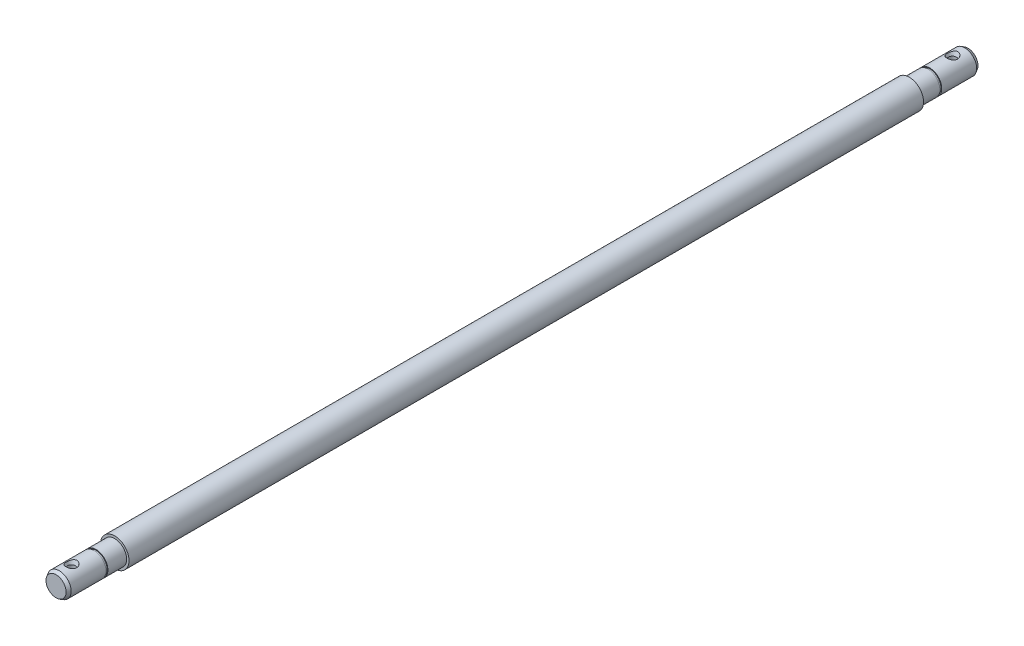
ISO-10303-21;
HEADER;
FILE_DESCRIPTION(('STEP AP214'),'2;1');
FILE_NAME('part.step','',(''),(''),'','','');
FILE_SCHEMA(('AUTOMOTIVE_DESIGN { 1 0 10303 214 1 1 1 1 }'));
ENDSEC;
DATA;
#1=APPLICATION_CONTEXT('core data for automotive mechanical design processes');
#2=APPLICATION_PROTOCOL_DEFINITION('international standard','automotive_design',2000,#1);
#3=PRODUCT_CONTEXT('',#1,'mechanical');
#4=PRODUCT('Part','Part','',(#3));
#5=PRODUCT_RELATED_PRODUCT_CATEGORY('part','',(#4));
#6=PRODUCT_DEFINITION_FORMATION('','',#4);
#7=PRODUCT_DEFINITION_CONTEXT('part definition',#1,'design');
#8=PRODUCT_DEFINITION('design','',#6,#7);
#9=PRODUCT_DEFINITION_SHAPE('','',#8);
#10=(LENGTH_UNIT() NAMED_UNIT(*) SI_UNIT(.MILLI.,.METRE.));
#11=(NAMED_UNIT(*) PLANE_ANGLE_UNIT() SI_UNIT($,.RADIAN.));
#12=(NAMED_UNIT(*) SI_UNIT($,.STERADIAN.) SOLID_ANGLE_UNIT());
#13=UNCERTAINTY_MEASURE_WITH_UNIT(LENGTH_MEASURE(1.E-05),#10,'distance_accuracy_value','');
#14=(GEOMETRIC_REPRESENTATION_CONTEXT(3) GLOBAL_UNCERTAINTY_ASSIGNED_CONTEXT((#13)) GLOBAL_UNIT_ASSIGNED_CONTEXT((#10,
#11,#12)) REPRESENTATION_CONTEXT('',''));
#15=CARTESIAN_POINT('',(0.,0.,0.));
#16=DIRECTION('',(0.,0.,1.));
#17=DIRECTION('',(1.,0.,0.));
#18=AXIS2_PLACEMENT_3D('',#15,#16,#17);
#19=CARTESIAN_POINT('',(0.,0.,287.5));
#20=DIRECTION('',(0.,0.,-1.));
#21=DIRECTION('',(-1.,0.,0.));
#22=AXIS2_PLACEMENT_3D('',#19,#20,#21);
#23=CYLINDRICAL_SURFACE('',#22,7.5);
#24=CARTESIAN_POINT('',(0.,0.,2.));
#25=DIRECTION('',(0.,0.,1.));
#26=DIRECTION('',(1.,0.,0.));
#27=AXIS2_PLACEMENT_3D('',#24,#25,#26);
#28=CIRCLE('',#27,7.5);
#29=CARTESIAN_POINT('',(7.5,0.,2.));
#30=VERTEX_POINT('',#29);
#31=EDGE_CURVE('E78',#30,#30,#28,.T.);
#32=ORIENTED_EDGE('',*,*,#31,.T.);
#33=EDGE_LOOP('',(#32));
#34=FACE_BOUND('',#33,.T.);
#35=CARTESIAN_POINT('',(-2.37306753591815,-7.11467190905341,7.39909261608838));
#36=CARTESIAN_POINT('',(-2.50121158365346,-7.07193088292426,7.55360555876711));
#37=CARTESIAN_POINT('',(-2.6158120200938,-7.02986523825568,7.71956594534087));
#38=CARTESIAN_POINT('',(-2.81591307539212,-6.95213613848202,8.06953074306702));
#39=CARTESIAN_POINT('',(-2.90141119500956,-6.91647323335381,8.25353670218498));
#40=CARTESIAN_POINT('',(-3.04098717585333,-6.85624986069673,8.63315832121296));
#41=CARTESIAN_POINT('',(-3.09530860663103,-6.83160366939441,8.8286704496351));
#42=CARTESIAN_POINT('',(-3.17208576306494,-6.79630034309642,9.2270275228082));
#43=CARTESIAN_POINT('',(-3.19455717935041,-6.78563632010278,9.42986880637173));
#44=CARTESIAN_POINT('',(-3.20679414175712,-6.77986041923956,9.83112233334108));
#45=CARTESIAN_POINT('',(-3.1974472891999,-6.78432645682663,10.0295018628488));
#46=CARTESIAN_POINT('',(-3.14829126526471,-6.80727397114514,10.421622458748));
#47=CARTESIAN_POINT('',(-3.10847828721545,-6.82575719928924,10.6153629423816));
#48=CARTESIAN_POINT('',(-2.99998724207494,-6.87412053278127,10.9911195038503));
#49=CARTESIAN_POINT('',(-2.93157227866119,-6.90389653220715,11.1732254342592));
#50=CARTESIAN_POINT('',(-2.76736656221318,-6.97133665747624,11.5231227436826));
#51=CARTESIAN_POINT('',(-2.67156566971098,-7.00900370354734,11.690908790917));
#52=CARTESIAN_POINT('',(-2.45019952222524,-7.08949046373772,12.0137537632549));
#53=CARTESIAN_POINT('',(-2.32367261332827,-7.13244837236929,12.1681214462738));
#54=CARTESIAN_POINT('',(-2.04493399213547,-7.21729993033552,12.4521343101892));
#55=CARTESIAN_POINT('',(-1.89272280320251,-7.25919360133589,12.5817799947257));
#56=CARTESIAN_POINT('',(-1.57132075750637,-7.33534097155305,12.8069693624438));
#57=CARTESIAN_POINT('',(-1.40291512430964,-7.3698115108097,12.9035518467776));
#58=CARTESIAN_POINT('',(-1.04938107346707,-7.42837229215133,13.063510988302));
#59=CARTESIAN_POINT('',(-0.864275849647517,-7.45247667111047,13.1269328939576));
#60=CARTESIAN_POINT('',(-0.508927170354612,-7.48455525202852,13.2104997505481));
#61=CARTESIAN_POINT('',(-0.339910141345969,-7.49422789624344,13.235223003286));
#62=CARTESIAN_POINT('',(8.58694290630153E-05,-7.50192226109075,13.254926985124));
#63=CARTESIAN_POINT('',(0.171063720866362,-7.49995038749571,13.2499240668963));
#64=CARTESIAN_POINT('',(0.493511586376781,-7.48532783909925,13.2123484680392));
#65=CARTESIAN_POINT('',(0.645336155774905,-7.47366979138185,13.18233774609));
#66=CARTESIAN_POINT('',(0.941719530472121,-7.44213572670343,13.09956667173));
#67=CARTESIAN_POINT('',(1.08627758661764,-7.42225886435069,13.046803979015));
#68=CARTESIAN_POINT('',(1.36989431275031,-7.37528303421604,12.918505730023));
#69=CARTESIAN_POINT('',(1.50857823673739,-7.34795371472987,12.8422314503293));
#70=CARTESIAN_POINT('',(1.77235436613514,-7.28883149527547,12.6704083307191));
#71=CARTESIAN_POINT('',(1.89744091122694,-7.25703674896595,12.5748515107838));
#72=CARTESIAN_POINT('',(2.14650497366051,-7.18757188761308,12.3546114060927));
#73=CARTESIAN_POINT('',(2.26853757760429,-7.14965517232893,12.2278068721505));
#74=CARTESIAN_POINT('',(2.49185161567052,-7.07492548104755,11.9567644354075));
#75=CARTESIAN_POINT('',(2.5931206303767,-7.03811317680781,11.8125161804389));
#76=CARTESIAN_POINT('',(2.78353264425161,-6.96516210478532,11.4930616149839));
#77=CARTESIAN_POINT('',(2.87010603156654,-6.9295455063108,11.3161955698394));
#78=CARTESIAN_POINT('',(3.01432345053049,-6.86804448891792,10.949448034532));
#79=CARTESIAN_POINT('',(3.0719680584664,-6.84215987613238,10.7595668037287));
#80=CARTESIAN_POINT('',(3.15757501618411,-6.80308819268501,10.3687775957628));
#81=CARTESIAN_POINT('',(3.18506185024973,-6.79010483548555,10.1677440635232));
#82=CARTESIAN_POINT('',(3.20786524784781,-6.77936394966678,9.76348346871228));
#83=CARTESIAN_POINT('',(3.2031889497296,-6.78160304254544,9.56025690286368));
#84=CARTESIAN_POINT('',(3.16256416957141,-6.8006350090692,9.16481296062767));
#85=CARTESIAN_POINT('',(3.12770147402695,-6.8169224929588,8.97245778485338));
#86=CARTESIAN_POINT('',(3.02912924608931,-6.86128775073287,8.59670045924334));
#87=CARTESIAN_POINT('',(2.96541290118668,-6.88936830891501,8.41330043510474));
#88=CARTESIAN_POINT('',(2.80910426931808,-6.95458173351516,8.05679167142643));
#89=CARTESIAN_POINT('',(2.71599528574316,-6.99187375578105,7.88393886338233));
#90=CARTESIAN_POINT('',(2.50294163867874,-7.07093881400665,7.5566704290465));
#91=CARTESIAN_POINT('',(2.38298609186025,-7.11271366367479,7.40226231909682));
#92=CARTESIAN_POINT('',(2.11524580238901,-7.1969305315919,7.11332898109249));
#93=CARTESIAN_POINT('',(1.96692109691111,-7.23936772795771,6.97929920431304));
#94=CARTESIAN_POINT('',(1.64702623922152,-7.31877036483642,6.74051652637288));
#95=CARTESIAN_POINT('',(1.47547249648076,-7.35573962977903,6.63574311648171));
#96=CARTESIAN_POINT('',(1.12883644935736,-7.41645875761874,6.46849516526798));
#97=CARTESIAN_POINT('',(0.955300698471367,-7.4410666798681,6.40317686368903));
#98=CARTESIAN_POINT('',(0.68754521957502,-7.46896259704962,6.330053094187));
#99=CARTESIAN_POINT('',(0.597046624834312,-7.47675874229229,6.30982038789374));
#100=CARTESIAN_POINT('',(0.414341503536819,-7.4891055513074,6.27791939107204));
#101=CARTESIAN_POINT('',(0.322135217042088,-7.49365666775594,6.26624990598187));
#102=CARTESIAN_POINT('',(0.068982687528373,-7.50139363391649,6.24641107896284));
#103=CARTESIAN_POINT('',(-0.0928611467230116,-7.50113984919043,6.24706089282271));
#104=CARTESIAN_POINT('',(-0.413779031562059,-7.49030156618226,6.27485218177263));
#105=CARTESIAN_POINT('',(-0.572853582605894,-7.4797189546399,6.30198881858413));
#106=CARTESIAN_POINT('',(-0.877468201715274,-7.45000319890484,6.3796599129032));
#107=CARTESIAN_POINT('',(-1.02329502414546,-7.43122781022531,6.42921829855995));
#108=CARTESIAN_POINT('',(-1.30495390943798,-7.38697913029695,6.54922428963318));
#109=CARTESIAN_POINT('',(-1.44078252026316,-7.361503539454,6.61967906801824));
#110=CARTESIAN_POINT('',(-1.72287734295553,-7.30109502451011,6.79304678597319));
#111=CARTESIAN_POINT('',(-1.86678945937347,-7.26528696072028,6.89948659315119));
#112=CARTESIAN_POINT('',(-2.1350563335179,-7.19103450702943,7.13396434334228));
#113=CARTESIAN_POINT('',(-2.25939098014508,-7.15258746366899,7.26202421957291));
#114=CARTESIAN_POINT('',(-2.37306753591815,-7.11467190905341,7.39909261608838));
#115=B_SPLINE_CURVE_WITH_KNOTS('',3,(#35,#36,#37,#38,#39,#40,#41,#42,#43,#44,#45,#46,#47,#48,
#49,#50,#51,#52,#53,#54,#55,#56,#57,#58,#59,#60,#61,#62,#63,#64,#65,#66,#67,#68,#69,#70,#71,#72,
#73,#74,#75,#76,#77,#78,#79,#80,#81,#82,#83,#84,#85,#86,#87,#88,#89,#90,#91,#92,#93,#94,#95,#96,
#97,#98,#99,#100,#101,#102,#103,#104,#105,#106,#107,#108,#109,#110,#111,#112,#113,#114),
.UNSPECIFIED.,.T.,.F.,(4,2,2,2,2,2,2,2,2,2,2,2,2,2,2,2,2,2,2,2,2,2,2,2,2,2,2,2,2,2,2,2,2,2,2,2,
2,2,2,4),(0.,0.615035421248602,1.23012364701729,1.84033865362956,2.45025293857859,
3.04329410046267,3.63640937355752,4.22418474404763,4.81217801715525,5.42170759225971,
6.03122474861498,6.61931015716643,7.20659099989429,7.71699522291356,8.22711869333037,
8.69061171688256,9.15415242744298,9.63407044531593,10.1141874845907,10.6520815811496,
11.190296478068,11.7878774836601,12.385446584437,12.9923082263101,13.5990351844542,
14.1848045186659,14.7707122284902,15.3675542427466,15.9646386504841,16.5744836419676,
17.1839000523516,17.7413829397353,18.0201527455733,18.2988836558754,18.7817032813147,
19.2644347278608,19.7279184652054,20.1915614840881,20.7366029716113,21.2822007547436),.UNSPECIFIED.);
#116=CARTESIAN_POINT('',(-2.37306753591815,-7.11467190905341,7.39909261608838));
#117=VERTEX_POINT('',#116);
#118=EDGE_CURVE('E42',#117,#117,#115,.T.);
#119=ORIENTED_EDGE('',*,*,#118,.T.);
#120=EDGE_LOOP('',(#119));
#121=FACE_BOUND('',#120,.T.);
#122=CARTESIAN_POINT('',(-2.37306753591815,7.11467190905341,7.39909261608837));
#123=CARTESIAN_POINT('',(-2.24488078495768,7.15742863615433,7.24454331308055));
#124=CARTESIAN_POINT('',(-2.10290799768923,7.20093586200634,7.10117163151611));
#125=CARTESIAN_POINT('',(-1.79373474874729,7.28409692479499,6.84226600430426));
#126=CARTESIAN_POINT('',(-1.62647474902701,7.32374129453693,6.72679947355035));
#127=CARTESIAN_POINT('',(-1.36703329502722,7.37483905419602,6.58301825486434));
#128=CARTESIAN_POINT('',(-1.28286151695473,7.3899858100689,6.54123326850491));
#129=CARTESIAN_POINT('',(-1.11069652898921,7.41781213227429,6.46549018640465));
#130=CARTESIAN_POINT('',(-1.02270546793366,7.43049306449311,6.43152775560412));
#131=CARTESIAN_POINT('',(-0.843705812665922,7.45293762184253,6.37199137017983));
#132=CARTESIAN_POINT('',(-0.752701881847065,7.46270554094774,6.346405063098));
#133=CARTESIAN_POINT('',(-0.568428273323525,7.4790016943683,6.30398480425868));
#134=CARTESIAN_POINT('',(-0.475158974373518,7.48553046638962,6.28714939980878));
#135=CARTESIAN_POINT('',(-0.218867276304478,7.49855715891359,6.25362861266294));
#136=CARTESIAN_POINT('',(-0.0543784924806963,7.50158944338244,6.24593105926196));
#137=CARTESIAN_POINT('',(0.273303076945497,7.49681287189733,6.25815531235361));
#138=CARTESIAN_POINT('',(0.436496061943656,7.48900571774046,6.27807278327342));
#139=CARTESIAN_POINT('',(0.747114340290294,7.46422643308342,6.3423686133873));
#140=CARTESIAN_POINT('',(0.894902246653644,7.44782106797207,6.38523749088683));
#141=CARTESIAN_POINT('',(1.18138730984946,7.40778466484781,6.49243225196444));
#142=CARTESIAN_POINT('',(1.32008292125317,7.38415240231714,6.55676177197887));
#143=CARTESIAN_POINT('',(1.59464002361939,7.3299385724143,6.70941645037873));
#144=CARTESIAN_POINT('',(1.72969749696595,7.29899899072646,6.79905443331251));
#145=CARTESIAN_POINT('',(1.98440380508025,7.23391026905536,6.9970670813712));
#146=CARTESIAN_POINT('',(2.10404487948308,7.19975952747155,7.10545111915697));
#147=CARTESIAN_POINT('',(2.34071164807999,7.12659254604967,7.35312641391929));
#148=CARTESIAN_POINT('',(2.45543881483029,7.08751346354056,7.49459836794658));
#149=CARTESIAN_POINT('',(2.66186356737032,7.01260059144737,7.79425859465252));
#150=CARTESIAN_POINT('',(2.75354914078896,6.97676850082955,7.95245552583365));
#151=CARTESIAN_POINT('',(2.91959464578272,6.90903376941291,8.29677937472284));
#152=CARTESIAN_POINT('',(2.99167563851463,6.87776795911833,8.48413889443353));
#153=CARTESIAN_POINT('',(3.10515375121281,6.82729210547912,8.86946106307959));
#154=CARTESIAN_POINT('',(3.14655764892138,6.80807939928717,9.06742135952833));
#155=CARTESIAN_POINT('',(3.19727248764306,6.78441186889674,9.46635184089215));
#156=CARTESIAN_POINT('',(3.20688978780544,6.77981618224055,9.66727443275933));
#157=CARTESIAN_POINT('',(3.19457781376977,6.78562566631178,10.0679147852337));
#158=CARTESIAN_POINT('',(3.1726508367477,6.79602974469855,10.2676326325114));
#159=CARTESIAN_POINT('',(3.09892200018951,6.82995196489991,10.6548294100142));
#160=CARTESIAN_POINT('',(3.04791361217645,6.85312127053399,10.8424916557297));
#161=CARTESIAN_POINT('',(2.91789035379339,6.90947961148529,11.2062772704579));
#162=CARTESIAN_POINT('',(2.8388668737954,6.94267172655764,11.3823970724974));
#163=CARTESIAN_POINT('',(2.65137653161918,7.01645560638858,11.724144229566));
#164=CARTESIAN_POINT('',(2.54205010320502,7.05724980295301,11.8892569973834));
#165=CARTESIAN_POINT('',(2.2969379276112,7.14078509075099,12.1981119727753));
#166=CARTESIAN_POINT('',(2.16114452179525,7.1835267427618,12.3418479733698));
#167=CARTESIAN_POINT('',(1.86560786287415,7.26587689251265,12.6028169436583));
#168=CARTESIAN_POINT('',(1.70590917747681,7.30549101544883,12.720098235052));
#169=CARTESIAN_POINT('',(1.36590222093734,7.37660607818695,12.9230116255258));
#170=CARTESIAN_POINT('',(1.18561727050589,7.40811606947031,13.0086790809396));
#171=CARTESIAN_POINT('',(0.831186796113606,7.45569738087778,13.135599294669));
#172=CARTESIAN_POINT('',(0.658624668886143,7.47310489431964,13.1807588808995));
#173=CARTESIAN_POINT('',(0.307447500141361,7.49575293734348,13.2392323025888));
#174=CARTESIAN_POINT('',(0.128838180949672,7.5010046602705,13.252575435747));
#175=CARTESIAN_POINT('',(-0.206482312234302,7.49880851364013,13.2469475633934));
#176=CARTESIAN_POINT('',(-0.363278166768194,7.49279301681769,13.2316215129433));
#177=CARTESIAN_POINT('',(-0.671812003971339,7.47145064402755,13.17645036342));
#178=CARTESIAN_POINT('',(-0.823550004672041,7.45612380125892,13.1366053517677));
#179=CARTESIAN_POINT('',(-1.11762451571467,7.41774057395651,13.0344599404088));
#180=CARTESIAN_POINT('',(-1.25998806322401,7.39470769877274,12.9722277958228));
#181=CARTESIAN_POINT('',(-1.53300828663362,7.34297093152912,12.8277546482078));
#182=CARTESIAN_POINT('',(-1.66366127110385,7.31426526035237,12.7455073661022));
#183=CARTESIAN_POINT('',(-1.92411120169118,7.25035161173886,12.5541374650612));
#184=CARTESIAN_POINT('',(-2.05241908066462,7.21477813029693,12.4431139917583));
#185=CARTESIAN_POINT('',(-2.2906187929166,7.1427293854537,12.2030534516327));
#186=CARTESIAN_POINT('',(-2.40049963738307,7.10625359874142,12.0740057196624));
#187=CARTESIAN_POINT('',(-2.61298434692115,7.03111378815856,11.7838250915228));
#188=CARTESIAN_POINT('',(-2.71297829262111,6.99274286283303,11.6206978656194));
#189=CARTESIAN_POINT('',(-2.88637925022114,6.9229746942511,11.2794734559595));
#190=CARTESIAN_POINT('',(-2.95977932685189,6.89157927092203,11.1013723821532));
#191=CARTESIAN_POINT('',(-3.08130964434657,6.83814242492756,10.7258239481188));
#192=CARTESIAN_POINT('',(-3.12808214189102,6.81661302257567,10.5278601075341));
#193=CARTESIAN_POINT('',(-3.18946153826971,6.78811563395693,10.1260430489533));
#194=CARTESIAN_POINT('',(-3.20408320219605,6.78114096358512,9.92219257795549));
#195=CARTESIAN_POINT('',(-3.20079336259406,6.78269173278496,9.52157002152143));
#196=CARTESIAN_POINT('',(-3.18393915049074,6.7907134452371,9.32478626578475));
#197=CARTESIAN_POINT('',(-3.12024216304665,6.82021223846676,8.93701961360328));
#198=CARTESIAN_POINT('',(-3.0733740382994,6.84170069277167,8.74604176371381));
#199=CARTESIAN_POINT('',(-2.9508757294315,6.89541744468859,8.37517447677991));
#200=CARTESIAN_POINT('',(-2.87523753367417,6.92764873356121,8.19528814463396));
#201=CARTESIAN_POINT('',(-2.69684981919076,6.99901069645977,7.85142151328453));
#202=CARTESIAN_POINT('',(-2.59417093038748,7.03812330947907,7.68740127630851));
#203=CARTESIAN_POINT('',(-2.4447641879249,7.09044713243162,7.48777626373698));
#204=CARTESIAN_POINT('',(-2.409471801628,7.10252925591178,7.44298368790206));
#205=CARTESIAN_POINT('',(-2.37306753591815,7.11467190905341,7.39909261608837));
#206=B_SPLINE_CURVE_WITH_KNOTS('',3,(#122,#123,#124,#125,#126,#127,#128,#129,#130,#131,#132,
#133,#134,#135,#136,#137,#138,#139,#140,#141,#142,#143,#144,#145,#146,#147,#148,#149,#150,#151,
#152,#153,#154,#155,#156,#157,#158,#159,#160,#161,#162,#163,#164,#165,#166,#167,#168,#169,#170,
#171,#172,#173,#174,#175,#176,#177,#178,#179,#180,#181,#182,#183,#184,#185,#186,#187,#188,#189,
#190,#191,#192,#193,#194,#195,#196,#197,#198,#199,#200,#201,#202,#203,#204,#205),.UNSPECIFIED.,
.T.,.F.,(4,2,2,2,2,2,2,2,2,2,2,2,2,2,2,2,2,2,2,2,2,2,2,2,2,2,2,2,2,2,2,2,2,2,2,2,2,2,2,2,2,4),
(0.,0.615711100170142,1.23289512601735,1.51809575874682,1.80313795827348,2.08775788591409,
2.37233055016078,2.8635651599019,3.35472265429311,3.81695761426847,4.27927093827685,
4.77237590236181,5.26572812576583,5.82228223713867,6.37912590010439,6.98570583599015,
7.59215171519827,8.1927353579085,8.79327526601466,9.37816431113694,9.96323326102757,
10.566983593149,11.1709088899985,11.7737219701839,12.3758588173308,12.9103892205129,
13.4444272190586,13.9151249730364,14.3858210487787,14.8550940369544,15.3245144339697,
15.8425346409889,16.3608626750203,16.9437338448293,17.5267569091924,18.1373255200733,
18.7476136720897,19.3377696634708,19.9284247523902,20.5192444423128,21.1085359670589,
21.2833942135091),.UNSPECIFIED.);
#207=CARTESIAN_POINT('',(-2.37306753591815,7.11467190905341,7.39909261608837));
#208=VERTEX_POINT('',#207);
#209=EDGE_CURVE('E10',#208,#208,#206,.T.);
#210=ORIENTED_EDGE('',*,*,#209,.T.);
#211=EDGE_LOOP('',(#210));
#212=FACE_BOUND('',#211,.T.);
#213=CARTESIAN_POINT('',(0.,0.,24.));
#214=DIRECTION('',(0.,0.,-1.));
#215=DIRECTION('',(-1.,0.,0.));
#216=AXIS2_PLACEMENT_3D('',#213,#214,#215);
#217=CIRCLE('',#216,7.5);
#218=CARTESIAN_POINT('',(-7.5,0.,24.));
#219=VERTEX_POINT('',#218);
#220=EDGE_CURVE('E97',#219,#219,#217,.T.);
#221=ORIENTED_EDGE('',*,*,#220,.T.);
#222=EDGE_LOOP('',(#221));
#223=FACE_BOUND('',#222,.T.);
#224=ADVANCED_FACE('F34',(#34,#121,#212,#223),#23,.T.);
#225=CARTESIAN_POINT('',(0.,0.,0.));
#226=DIRECTION('',(0.,0.,1.));
#227=DIRECTION('',(1.,0.,0.));
#228=AXIS2_PLACEMENT_3D('',#225,#226,#227);
#229=PLANE('',#228);
#230=CARTESIAN_POINT('',(0.,0.,0.));
#231=DIRECTION('',(0.,0.,1.));
#232=DIRECTION('',(1.,0.,0.));
#233=AXIS2_PLACEMENT_3D('',#230,#231,#232);
#234=CIRCLE('',#233,6.34529946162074);
#235=CARTESIAN_POINT('',(6.34529946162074,0.,0.));
#236=VERTEX_POINT('',#235);
#237=EDGE_CURVE('E46',#236,#236,#234,.F.);
#238=ORIENTED_EDGE('',*,*,#237,.T.);
#239=EDGE_LOOP('',(#238));
#240=FACE_BOUND('',#239,.T.);
#241=ADVANCED_FACE('F67',(#240),#229,.F.);
#242=CARTESIAN_POINT('',(0.,0.,2.));
#243=DIRECTION('',(0.,0.,1.));
#244=DIRECTION('',(1.,0.,0.));
#245=AXIS2_PLACEMENT_3D('',#242,#243,#244);
#246=CONICAL_SURFACE('',#245,7.5,0.523598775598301);
#247=ORIENTED_EDGE('',*,*,#237,.F.);
#248=EDGE_LOOP('',(#247));
#249=FACE_BOUND('',#248,.T.);
#250=ORIENTED_EDGE('',*,*,#31,.F.);
#251=EDGE_LOOP('',(#250));
#252=FACE_BOUND('',#251,.T.);
#253=ADVANCED_FACE('F36',(#249,#252),#246,.T.);
#254=CARTESIAN_POINT('',(0.,7.5,9.74999999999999));
#255=DIRECTION('',(0.,1.,0.));
#256=DIRECTION('',(0.,0.,1.));
#257=AXIS2_PLACEMENT_3D('',#254,#255,#256);
#258=CONICAL_SURFACE('',#257,3.5,0.392699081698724);
#259=CARTESIAN_POINT('',(0.,5.0857864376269,9.74999999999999));
#260=DIRECTION('',(0.,1.,0.));
#261=DIRECTION('',(0.,0.,1.));
#262=AXIS2_PLACEMENT_3D('',#259,#260,#261);
#263=CIRCLE('',#262,2.5);
#264=CARTESIAN_POINT('',(0.,5.0857864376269,12.25));
#265=VERTEX_POINT('',#264);
#266=EDGE_CURVE('E80',#265,#265,#263,.T.);
#267=ORIENTED_EDGE('',*,*,#266,.F.);
#268=EDGE_LOOP('',(#267));
#269=FACE_BOUND('',#268,.T.);
#270=ORIENTED_EDGE('',*,*,#209,.F.);
#271=EDGE_LOOP('',(#270));
#272=FACE_BOUND('',#271,.T.);
#273=ADVANCED_FACE('F60',(#269,#272),#258,.F.);
#274=CARTESIAN_POINT('',(0.,-5.08578643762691,9.74999999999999));
#275=DIRECTION('',(0.,-1.,0.));
#276=DIRECTION('',(0.,0.,-1.));
#277=AXIS2_PLACEMENT_3D('',#274,#275,#276);
#278=CONICAL_SURFACE('',#277,2.5,0.392699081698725);
#279=CARTESIAN_POINT('',(0.,-5.08578643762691,9.74999999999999));
#280=DIRECTION('',(0.,1.,0.));
#281=DIRECTION('',(0.,0.,1.));
#282=AXIS2_PLACEMENT_3D('',#279,#280,#281);
#283=CIRCLE('',#282,2.5);
#284=CARTESIAN_POINT('',(0.,-5.08578643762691,12.25));
#285=VERTEX_POINT('',#284);
#286=EDGE_CURVE('E85',#285,#285,#283,.T.);
#287=ORIENTED_EDGE('',*,*,#286,.T.);
#288=EDGE_LOOP('',(#287));
#289=FACE_BOUND('',#288,.T.);
#290=ORIENTED_EDGE('',*,*,#118,.F.);
#291=EDGE_LOOP('',(#290));
#292=FACE_BOUND('',#291,.T.);
#293=ADVANCED_FACE('F64',(#289,#292),#278,.F.);
#294=CARTESIAN_POINT('',(0.,7.5,9.74999999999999));
#295=DIRECTION('',(0.,1.,0.));
#296=DIRECTION('',(0.,0.,1.));
#297=AXIS2_PLACEMENT_3D('',#294,#295,#296);
#298=CYLINDRICAL_SURFACE('',#297,2.5);
#299=ORIENTED_EDGE('',*,*,#286,.F.);
#300=EDGE_LOOP('',(#299));
#301=FACE_BOUND('',#300,.T.);
#302=ORIENTED_EDGE('',*,*,#266,.T.);
#303=EDGE_LOOP('',(#302));
#304=FACE_BOUND('',#303,.T.);
#305=ADVANCED_FACE('F66',(#301,#304),#298,.F.);
#306=CARTESIAN_POINT('',(7.5,0.,25.2));
#307=DIRECTION('',(0.,0.,-1.));
#308=DIRECTION('',(-1.,0.,0.));
#309=AXIS2_PLACEMENT_3D('',#306,#307,#308);
#310=PLANE('',#309);
#311=CARTESIAN_POINT('',(0.,0.,25.2));
#312=DIRECTION('',(0.,0.,-1.));
#313=DIRECTION('',(-1.,0.,0.));
#314=AXIS2_PLACEMENT_3D('',#311,#312,#313);
#315=CIRCLE('',#314,7.5);
#316=CARTESIAN_POINT('',(-7.5,0.,25.2));
#317=VERTEX_POINT('',#316);
#318=EDGE_CURVE('E88',#317,#317,#315,.T.);
#319=ORIENTED_EDGE('',*,*,#318,.T.);
#320=EDGE_LOOP('',(#319));
#321=FACE_BOUND('',#320,.T.);
#322=CARTESIAN_POINT('',(0.,0.,25.2));
#323=DIRECTION('',(0.,0.,-1.));
#324=DIRECTION('',(-1.,0.,0.));
#325=AXIS2_PLACEMENT_3D('',#322,#323,#324);
#326=CIRCLE('',#325,7.);
#327=CARTESIAN_POINT('',(-7.,0.,25.2));
#328=VERTEX_POINT('',#327);
#329=EDGE_CURVE('E91',#328,#328,#326,.T.);
#330=ORIENTED_EDGE('',*,*,#329,.F.);
#331=EDGE_LOOP('',(#330));
#332=FACE_BOUND('',#331,.T.);
#333=ADVANCED_FACE('F195',(#321,#332),#310,.T.);
#334=CARTESIAN_POINT('',(0.,0.,0.));
#335=DIRECTION('',(0.,0.,-1.));
#336=DIRECTION('',(-1.,0.,0.));
#337=AXIS2_PLACEMENT_3D('',#334,#335,#336);
#338=CYLINDRICAL_SURFACE('',#337,7.);
#339=ORIENTED_EDGE('',*,*,#329,.T.);
#340=EDGE_LOOP('',(#339));
#341=FACE_BOUND('',#340,.T.);
#342=CARTESIAN_POINT('',(0.,0.,24.));
#343=DIRECTION('',(0.,0.,-1.));
#344=DIRECTION('',(-1.,0.,0.));
#345=AXIS2_PLACEMENT_3D('',#342,#343,#344);
#346=CIRCLE('',#345,7.);
#347=CARTESIAN_POINT('',(-7.,0.,24.));
#348=VERTEX_POINT('',#347);
#349=EDGE_CURVE('E94',#348,#348,#346,.T.);
#350=ORIENTED_EDGE('',*,*,#349,.F.);
#351=EDGE_LOOP('',(#350));
#352=FACE_BOUND('',#351,.T.);
#353=ADVANCED_FACE('F191',(#341,#352),#338,.T.);
#354=CARTESIAN_POINT('',(7.5,0.,24.));
#355=DIRECTION('',(0.,0.,1.));
#356=DIRECTION('',(1.,0.,0.));
#357=AXIS2_PLACEMENT_3D('',#354,#355,#356);
#358=PLANE('',#357);
#359=ORIENTED_EDGE('',*,*,#349,.T.);
#360=EDGE_LOOP('',(#359));
#361=FACE_BOUND('',#360,.T.);
#362=ORIENTED_EDGE('',*,*,#220,.F.);
#363=EDGE_LOOP('',(#362));
#364=FACE_BOUND('',#363,.T.);
#365=ADVANCED_FACE('F188',(#361,#364),#358,.T.);
#366=CARTESIAN_POINT('',(0.,0.,37.));
#367=DIRECTION('',(0.,0.,-1.));
#368=DIRECTION('',(-1.,0.,0.));
#369=AXIS2_PLACEMENT_3D('',#366,#367,#368);
#370=CIRCLE('',#369,7.5);
#371=CARTESIAN_POINT('',(-7.5,0.,37.));
#372=VERTEX_POINT('',#371);
#373=EDGE_CURVE('E38',#372,#372,#370,.T.);
#374=ORIENTED_EDGE('',*,*,#373,.T.);
#375=EDGE_LOOP('',(#374));
#376=FACE_BOUND('',#375,.T.);
#377=ORIENTED_EDGE('',*,*,#318,.F.);
#378=EDGE_LOOP('',(#377));
#379=FACE_BOUND('',#378,.T.);
#380=ADVANCED_FACE('F57',(#376,#379),#23,.T.);
#381=CARTESIAN_POINT('',(0.,0.,37.));
#382=DIRECTION('',(0.,0.,-1.));
#383=DIRECTION('',(-1.,0.,0.));
#384=AXIS2_PLACEMENT_3D('',#381,#382,#383);
#385=PLANE('',#384);
#386=CARTESIAN_POINT('',(0.,0.,37.));
#387=DIRECTION('',(0.,0.,-1.));
#388=DIRECTION('',(-1.,0.,0.));
#389=AXIS2_PLACEMENT_3D('',#386,#387,#388);
#390=CIRCLE('',#389,9.);
#391=CARTESIAN_POINT('',(-9.,0.,37.));
#392=VERTEX_POINT('',#391);
#393=EDGE_CURVE('E100',#392,#392,#390,.F.);
#394=ORIENTED_EDGE('',*,*,#393,.F.);
#395=EDGE_LOOP('',(#394));
#396=FACE_BOUND('',#395,.T.);
#397=ORIENTED_EDGE('',*,*,#373,.F.);
#398=EDGE_LOOP('',(#397));
#399=FACE_BOUND('',#398,.T.);
#400=ADVANCED_FACE('F183',(#396,#399),#385,.T.);
#401=CARTESIAN_POINT('',(0.,0.,11.5441558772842));
#402=DIRECTION('',(0.,0.,1.));
#403=DIRECTION('',(1.,0.,0.));
#404=AXIS2_PLACEMENT_3D('',#401,#402,#403);
#405=CYLINDRICAL_SURFACE('',#404,9.);
#406=ORIENTED_EDGE('',*,*,#393,.T.);
#407=EDGE_LOOP('',(#406));
#408=FACE_BOUND('',#407,.T.);
#409=CARTESIAN_POINT('',(0.,0.,538.));
#410=DIRECTION('',(0.,0.,-1.));
#411=DIRECTION('',(-1.,0.,0.));
#412=AXIS2_PLACEMENT_3D('',#409,#410,#411);
#413=CIRCLE('',#412,9.);
#414=CARTESIAN_POINT('',(-9.,0.,538.));
#415=VERTEX_POINT('',#414);
#416=EDGE_CURVE('E103',#415,#415,#413,.F.);
#417=ORIENTED_EDGE('',*,*,#416,.F.);
#418=EDGE_LOOP('',(#417));
#419=FACE_BOUND('',#418,.T.);
#420=ADVANCED_FACE('F179',(#408,#419),#405,.T.);
#421=CARTESIAN_POINT('',(0.,0.,575.));
#422=DIRECTION('',(0.,0.,-1.));
#423=DIRECTION('',(1.,0.,0.));
#424=AXIS2_PLACEMENT_3D('',#421,#422,#423);
#425=PLANE('',#424);
#426=CARTESIAN_POINT('',(0.,0.,575.));
#427=DIRECTION('',(0.,0.,1.));
#428=DIRECTION('',(1.,0.,0.));
#429=AXIS2_PLACEMENT_3D('',#426,#427,#428);
#430=CIRCLE('',#429,6.34529946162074);
#431=CARTESIAN_POINT('',(6.34529946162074,0.,575.));
#432=VERTEX_POINT('',#431);
#433=EDGE_CURVE('E124',#432,#432,#430,.F.);
#434=ORIENTED_EDGE('',*,*,#433,.F.);
#435=EDGE_LOOP('',(#434));
#436=FACE_BOUND('',#435,.T.);
#437=ADVANCED_FACE('F175',(#436),#425,.F.);
#438=CARTESIAN_POINT('',(0.,0.,538.));
#439=DIRECTION('',(0.,0.,1.));
#440=DIRECTION('',(-1.,0.,0.));
#441=AXIS2_PLACEMENT_3D('',#438,#439,#440);
#442=PLANE('',#441);
#443=ORIENTED_EDGE('',*,*,#416,.T.);
#444=EDGE_LOOP('',(#443));
#445=FACE_BOUND('',#444,.T.);
#446=CARTESIAN_POINT('',(0.,0.,538.));
#447=DIRECTION('',(0.,0.,-1.));
#448=DIRECTION('',(-1.,0.,0.));
#449=AXIS2_PLACEMENT_3D('',#446,#447,#448);
#450=CIRCLE('',#449,7.5);
#451=CARTESIAN_POINT('',(-7.5,0.,538.));
#452=VERTEX_POINT('',#451);
#453=EDGE_CURVE('E106',#452,#452,#450,.T.);
#454=ORIENTED_EDGE('',*,*,#453,.T.);
#455=EDGE_LOOP('',(#454));
#456=FACE_BOUND('',#455,.T.);
#457=ADVANCED_FACE('F172',(#445,#456),#442,.T.);
#458=CARTESIAN_POINT('',(0.,0.,287.5));
#459=DIRECTION('',(0.,0.,1.));
#460=DIRECTION('',(-1.,0.,0.));
#461=AXIS2_PLACEMENT_3D('',#458,#459,#460);
#462=CYLINDRICAL_SURFACE('',#461,7.5);
#463=ORIENTED_EDGE('',*,*,#453,.F.);
#464=EDGE_LOOP('',(#463));
#465=FACE_BOUND('',#464,.T.);
#466=CARTESIAN_POINT('',(0.,0.,549.8));
#467=DIRECTION('',(0.,0.,-1.));
#468=DIRECTION('',(-1.,0.,0.));
#469=AXIS2_PLACEMENT_3D('',#466,#467,#468);
#470=CIRCLE('',#469,7.5);
#471=CARTESIAN_POINT('',(-7.5,0.,549.8));
#472=VERTEX_POINT('',#471);
#473=EDGE_CURVE('E109',#472,#472,#470,.T.);
#474=ORIENTED_EDGE('',*,*,#473,.T.);
#475=EDGE_LOOP('',(#474));
#476=FACE_BOUND('',#475,.T.);
#477=ADVANCED_FACE('F160',(#465,#476),#462,.T.);
#478=CARTESIAN_POINT('',(7.5,0.,549.8));
#479=DIRECTION('',(0.,0.,1.));
#480=DIRECTION('',(-1.,0.,0.));
#481=AXIS2_PLACEMENT_3D('',#478,#479,#480);
#482=PLANE('',#481);
#483=ORIENTED_EDGE('',*,*,#473,.F.);
#484=EDGE_LOOP('',(#483));
#485=FACE_BOUND('',#484,.T.);
#486=CARTESIAN_POINT('',(0.,0.,549.8));
#487=DIRECTION('',(0.,0.,-1.));
#488=DIRECTION('',(-1.,0.,0.));
#489=AXIS2_PLACEMENT_3D('',#486,#487,#488);
#490=CIRCLE('',#489,7.);
#491=CARTESIAN_POINT('',(-7.,0.,549.8));
#492=VERTEX_POINT('',#491);
#493=EDGE_CURVE('E112',#492,#492,#490,.T.);
#494=ORIENTED_EDGE('',*,*,#493,.T.);
#495=EDGE_LOOP('',(#494));
#496=FACE_BOUND('',#495,.T.);
#497=ADVANCED_FACE('F167',(#485,#496),#482,.T.);
#498=CARTESIAN_POINT('',(0.,0.,575.));
#499=DIRECTION('',(0.,0.,1.));
#500=DIRECTION('',(-1.,0.,0.));
#501=AXIS2_PLACEMENT_3D('',#498,#499,#500);
#502=CYLINDRICAL_SURFACE('',#501,7.);
#503=ORIENTED_EDGE('',*,*,#493,.F.);
#504=EDGE_LOOP('',(#503));
#505=FACE_BOUND('',#504,.T.);
#506=CARTESIAN_POINT('',(0.,0.,551.));
#507=DIRECTION('',(0.,0.,-1.));
#508=DIRECTION('',(-1.,0.,0.));
#509=AXIS2_PLACEMENT_3D('',#506,#507,#508);
#510=CIRCLE('',#509,7.);
#511=CARTESIAN_POINT('',(-7.,0.,551.));
#512=VERTEX_POINT('',#511);
#513=EDGE_CURVE('E115',#512,#512,#510,.T.);
#514=ORIENTED_EDGE('',*,*,#513,.T.);
#515=EDGE_LOOP('',(#514));
#516=FACE_BOUND('',#515,.T.);
#517=ADVANCED_FACE('F163',(#505,#516),#502,.T.);
#518=CARTESIAN_POINT('',(7.5,0.,551.));
#519=DIRECTION('',(0.,0.,-1.));
#520=DIRECTION('',(1.,0.,0.));
#521=AXIS2_PLACEMENT_3D('',#518,#519,#520);
#522=PLANE('',#521);
#523=ORIENTED_EDGE('',*,*,#513,.F.);
#524=EDGE_LOOP('',(#523));
#525=FACE_BOUND('',#524,.T.);
#526=CARTESIAN_POINT('',(0.,0.,551.));
#527=DIRECTION('',(0.,0.,-1.));
#528=DIRECTION('',(-1.,0.,0.));
#529=AXIS2_PLACEMENT_3D('',#526,#527,#528);
#530=CIRCLE('',#529,7.5);
#531=CARTESIAN_POINT('',(-7.5,0.,551.));
#532=VERTEX_POINT('',#531);
#533=EDGE_CURVE('E118',#532,#532,#530,.T.);
#534=ORIENTED_EDGE('',*,*,#533,.T.);
#535=EDGE_LOOP('',(#534));
#536=FACE_BOUND('',#535,.T.);
#537=ADVANCED_FACE('F158',(#525,#536),#522,.T.);
#538=CARTESIAN_POINT('',(-2.37306753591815,7.11467190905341,567.600907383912));
#539=CARTESIAN_POINT('',(-2.24488078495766,7.15742863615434,567.755456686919));
#540=CARTESIAN_POINT('',(-2.1029079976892,7.20093586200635,567.898828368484));
#541=CARTESIAN_POINT('',(-1.79373474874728,7.284096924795,568.157733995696));
#542=CARTESIAN_POINT('',(-1.62647474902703,7.32374129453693,568.27320052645));
#543=CARTESIAN_POINT('',(-1.3670332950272,7.37483905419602,568.416981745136));
#544=CARTESIAN_POINT('',(-1.28286151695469,7.38998581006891,568.458766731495));
#545=CARTESIAN_POINT('',(-1.11069652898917,7.41781213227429,568.534509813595));
#546=CARTESIAN_POINT('',(-1.02270546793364,7.43049306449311,568.568472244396));
#547=CARTESIAN_POINT('',(-0.843705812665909,7.45293762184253,568.62800862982));
#548=CARTESIAN_POINT('',(-0.752701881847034,7.46270554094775,568.653594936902));
#549=CARTESIAN_POINT('',(-0.568428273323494,7.4790016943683,568.696015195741));
#550=CARTESIAN_POINT('',(-0.475158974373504,7.48553046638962,568.712850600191));
#551=CARTESIAN_POINT('',(-0.218867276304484,7.49855715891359,568.746371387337));
#552=CARTESIAN_POINT('',(-0.0543784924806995,7.50158944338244,568.754068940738));
#553=CARTESIAN_POINT('',(0.2733030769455,7.49681287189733,568.741844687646));
#554=CARTESIAN_POINT('',(0.436496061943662,7.48900571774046,568.721927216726));
#555=CARTESIAN_POINT('',(0.74711434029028,7.46422643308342,568.657631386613));
#556=CARTESIAN_POINT('',(0.89490224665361,7.44782106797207,568.614762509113));
#557=CARTESIAN_POINT('',(1.18138730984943,7.40778466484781,568.507567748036));
#558=CARTESIAN_POINT('',(1.32008292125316,7.38415240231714,568.443238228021));
#559=CARTESIAN_POINT('',(1.59464002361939,7.3299385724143,568.290583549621));
#560=CARTESIAN_POINT('',(1.72969749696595,7.29899899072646,568.200945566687));
#561=CARTESIAN_POINT('',(1.98440380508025,7.23391026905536,568.002932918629));
#562=CARTESIAN_POINT('',(2.10404487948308,7.19975952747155,567.894548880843));
#563=CARTESIAN_POINT('',(2.34071164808,7.12659254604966,567.646873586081));
#564=CARTESIAN_POINT('',(2.4554388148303,7.08751346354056,567.505401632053));
#565=CARTESIAN_POINT('',(2.66186356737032,7.01260059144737,567.205741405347));
#566=CARTESIAN_POINT('',(2.75354914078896,6.97676850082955,567.047544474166));
#567=CARTESIAN_POINT('',(2.91959464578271,6.90903376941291,566.703220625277));
#568=CARTESIAN_POINT('',(2.99167563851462,6.87776795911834,566.515861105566));
#569=CARTESIAN_POINT('',(3.1051537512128,6.82729210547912,566.13053893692));
#570=CARTESIAN_POINT('',(3.14655764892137,6.80807939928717,565.932578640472));
#571=CARTESIAN_POINT('',(3.19727248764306,6.78441186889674,565.533648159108));
#572=CARTESIAN_POINT('',(3.20688978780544,6.77981618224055,565.332725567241));
#573=CARTESIAN_POINT('',(3.19457781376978,6.78562566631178,564.932085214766));
#574=CARTESIAN_POINT('',(3.1726508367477,6.79602974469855,564.732367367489));
#575=CARTESIAN_POINT('',(3.09892200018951,6.82995196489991,564.345170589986));
#576=CARTESIAN_POINT('',(3.04791361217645,6.85312127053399,564.15750834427));
#577=CARTESIAN_POINT('',(2.91789035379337,6.90947961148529,563.793722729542));
#578=CARTESIAN_POINT('',(2.83886687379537,6.94267172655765,563.617602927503));
#579=CARTESIAN_POINT('',(2.65137653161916,7.01645560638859,563.275855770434));
#580=CARTESIAN_POINT('',(2.54205010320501,7.05724980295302,563.110743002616));
#581=CARTESIAN_POINT('',(2.29693792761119,7.140785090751,562.801888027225));
#582=CARTESIAN_POINT('',(2.16114452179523,7.18352674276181,562.65815202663));
#583=CARTESIAN_POINT('',(1.86560786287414,7.26587689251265,562.397183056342));
#584=CARTESIAN_POINT('',(1.70590917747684,7.30549101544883,562.279901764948));
#585=CARTESIAN_POINT('',(1.36590222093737,7.37660607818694,562.076988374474));
#586=CARTESIAN_POINT('',(1.1856172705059,7.40811606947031,561.99132091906));
#587=CARTESIAN_POINT('',(0.831186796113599,7.45569738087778,561.864400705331));
#588=CARTESIAN_POINT('',(0.658624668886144,7.47310489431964,561.8192411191));
#589=CARTESIAN_POINT('',(0.307447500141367,7.49575293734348,561.760767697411));
#590=CARTESIAN_POINT('',(0.128838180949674,7.5010046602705,561.747424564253));
#591=CARTESIAN_POINT('',(-0.206482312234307,7.49880851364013,561.753052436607));
#592=CARTESIAN_POINT('',(-0.363278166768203,7.49279301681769,561.768378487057));
#593=CARTESIAN_POINT('',(-0.671812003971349,7.47145064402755,561.82354963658));
#594=CARTESIAN_POINT('',(-0.823550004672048,7.45612380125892,561.863394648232));
#595=CARTESIAN_POINT('',(-1.11762451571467,7.41774057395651,561.965540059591));
#596=CARTESIAN_POINT('',(-1.25998806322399,7.39470769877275,562.027772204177));
#597=CARTESIAN_POINT('',(-1.5330082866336,7.34297093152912,562.172245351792));
#598=CARTESIAN_POINT('',(-1.66366127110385,7.31426526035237,562.254492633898));
#599=CARTESIAN_POINT('',(-1.9241112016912,7.25035161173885,562.445862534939));
#600=CARTESIAN_POINT('',(-2.05241908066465,7.21477813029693,562.556886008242));
#601=CARTESIAN_POINT('',(-2.29061879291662,7.1427293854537,562.796946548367));
#602=CARTESIAN_POINT('',(-2.40049963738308,7.10625359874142,562.925994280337));
#603=CARTESIAN_POINT('',(-2.61298434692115,7.03111378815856,563.216174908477));
#604=CARTESIAN_POINT('',(-2.71297829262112,6.99274286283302,563.379302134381));
#605=CARTESIAN_POINT('',(-2.88637925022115,6.92297469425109,563.72052654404));
#606=CARTESIAN_POINT('',(-2.95977932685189,6.89157927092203,563.898627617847));
#607=CARTESIAN_POINT('',(-3.08130964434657,6.83814242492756,564.274176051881));
#608=CARTESIAN_POINT('',(-3.12808214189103,6.81661302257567,564.472139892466));
#609=CARTESIAN_POINT('',(-3.18946153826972,6.78811563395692,564.873956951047));
#610=CARTESIAN_POINT('',(-3.20408320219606,6.78114096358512,565.077807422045));
#611=CARTESIAN_POINT('',(-3.20079336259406,6.78269173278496,565.478429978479));
#612=CARTESIAN_POINT('',(-3.18393915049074,6.7907134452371,565.675213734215));
#613=CARTESIAN_POINT('',(-3.12024216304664,6.82021223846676,566.062980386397));
#614=CARTESIAN_POINT('',(-3.0733740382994,6.84170069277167,566.253958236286));
#615=CARTESIAN_POINT('',(-2.95087572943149,6.89541744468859,566.62482552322));
#616=CARTESIAN_POINT('',(-2.87523753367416,6.92764873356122,566.804711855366));
#617=CARTESIAN_POINT('',(-2.69684981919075,6.99901069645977,567.148578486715));
#618=CARTESIAN_POINT('',(-2.59417093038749,7.03812330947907,567.312598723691));
#619=CARTESIAN_POINT('',(-2.4447641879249,7.09044713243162,567.512223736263));
#620=CARTESIAN_POINT('',(-2.409471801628,7.10252925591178,567.557016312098));
#621=CARTESIAN_POINT('',(-2.37306753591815,7.11467190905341,567.600907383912));
#622=B_SPLINE_CURVE_WITH_KNOTS('',3,(#538,#539,#540,#541,#542,#543,#544,#545,#546,#547,#548,
#549,#550,#551,#552,#553,#554,#555,#556,#557,#558,#559,#560,#561,#562,#563,#564,#565,#566,#567,
#568,#569,#570,#571,#572,#573,#574,#575,#576,#577,#578,#579,#580,#581,#582,#583,#584,#585,#586,
#587,#588,#589,#590,#591,#592,#593,#594,#595,#596,#597,#598,#599,#600,#601,#602,#603,#604,#605,
#606,#607,#608,#609,#610,#611,#612,#613,#614,#615,#616,#617,#618,#619,#620,#621),.UNSPECIFIED.,
.T.,.F.,(4,2,2,2,2,2,2,2,2,2,2,2,2,2,2,2,2,2,2,2,2,2,2,2,2,2,2,2,2,2,2,2,2,2,2,2,2,2,2,2,2,4),
(0.,0.615711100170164,1.23289512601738,1.51809575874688,1.80313795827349,2.08775788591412,
2.37233055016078,2.8635651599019,3.35472265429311,3.81695761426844,4.27927093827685,
4.77237590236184,5.26572812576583,5.82228223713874,6.37912590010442,6.98570583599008,
7.59215171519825,8.19273535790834,8.79327526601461,9.37816431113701,9.96323326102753,
10.5669835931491,11.1709088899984,11.7737219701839,12.3758588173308,12.9103892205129,
13.4444272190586,13.9151249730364,14.3858210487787,14.8550940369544,15.3245144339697,
15.8425346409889,16.3608626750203,16.9437338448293,17.5267569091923,18.1373255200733,
18.7476136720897,19.3377696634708,19.9284247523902,20.5192444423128,21.1085359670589,
21.2833942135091),.UNSPECIFIED.);
#623=CARTESIAN_POINT('',(-2.37306753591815,7.11467190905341,567.600907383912));
#624=VERTEX_POINT('',#623);
#625=EDGE_CURVE('E133',#624,#624,#622,.T.);
#626=ORIENTED_EDGE('',*,*,#625,.F.);
#627=EDGE_LOOP('',(#626));
#628=FACE_BOUND('',#627,.T.);
#629=CARTESIAN_POINT('',(-2.37306753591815,-7.11467190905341,567.600907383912));
#630=CARTESIAN_POINT('',(-2.50121158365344,-7.07193088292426,567.446394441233));
#631=CARTESIAN_POINT('',(-2.61581202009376,-7.0298652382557,567.280434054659));
#632=CARTESIAN_POINT('',(-2.81591307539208,-6.95213613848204,566.930469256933));
#633=CARTESIAN_POINT('',(-2.90141119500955,-6.91647323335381,566.746463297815));
#634=CARTESIAN_POINT('',(-3.04098717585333,-6.85624986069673,566.366841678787));
#635=CARTESIAN_POINT('',(-3.09530860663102,-6.83160366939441,566.171329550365));
#636=CARTESIAN_POINT('',(-3.17208576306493,-6.79630034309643,565.772972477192));
#637=CARTESIAN_POINT('',(-3.1945571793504,-6.78563632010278,565.570131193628));
#638=CARTESIAN_POINT('',(-3.20679414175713,-6.77986041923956,565.168877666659));
#639=CARTESIAN_POINT('',(-3.1974472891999,-6.78432645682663,564.970498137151));
#640=CARTESIAN_POINT('',(-3.14829126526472,-6.80727397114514,564.578377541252));
#641=CARTESIAN_POINT('',(-3.10847828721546,-6.82575719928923,564.384637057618));
#642=CARTESIAN_POINT('',(-2.99998724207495,-6.87412053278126,564.00888049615));
#643=CARTESIAN_POINT('',(-2.9315722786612,-6.90389653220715,563.826774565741));
#644=CARTESIAN_POINT('',(-2.76736656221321,-6.97133665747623,563.476877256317));
#645=CARTESIAN_POINT('',(-2.671565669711,-7.00900370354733,563.309091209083));
#646=CARTESIAN_POINT('',(-2.45019952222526,-7.08949046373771,562.986246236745));
#647=CARTESIAN_POINT('',(-2.3236726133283,-7.13244837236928,562.831878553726));
#648=CARTESIAN_POINT('',(-2.04493399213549,-7.21729993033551,562.547865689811));
#649=CARTESIAN_POINT('',(-1.8927228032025,-7.25919360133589,562.418220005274));
#650=CARTESIAN_POINT('',(-1.57132075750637,-7.33534097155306,562.193030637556));
#651=CARTESIAN_POINT('',(-1.40291512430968,-7.36981151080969,562.096448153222));
#652=CARTESIAN_POINT('',(-1.04938107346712,-7.42837229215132,561.936489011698));
#653=CARTESIAN_POINT('',(-0.864275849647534,-7.45247667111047,561.873067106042));
#654=CARTESIAN_POINT('',(-0.508927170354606,-7.48455525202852,561.789500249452));
#655=CARTESIAN_POINT('',(-0.339910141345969,-7.49422789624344,561.764776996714));
#656=CARTESIAN_POINT('',(8.58694290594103E-05,-7.50192226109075,561.745073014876));
#657=CARTESIAN_POINT('',(0.17106372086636,-7.49995038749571,561.750075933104));
#658=CARTESIAN_POINT('',(0.493511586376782,-7.48532783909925,561.787651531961));
#659=CARTESIAN_POINT('',(0.645336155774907,-7.47366979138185,561.81766225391));
#660=CARTESIAN_POINT('',(0.941719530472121,-7.44213572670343,561.90043332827));
#661=CARTESIAN_POINT('',(1.08627758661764,-7.42225886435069,561.953196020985));
#662=CARTESIAN_POINT('',(1.36989431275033,-7.37528303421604,562.081494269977));
#663=CARTESIAN_POINT('',(1.50857823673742,-7.34795371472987,562.157768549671));
#664=CARTESIAN_POINT('',(1.77235436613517,-7.28883149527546,562.329591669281));
#665=CARTESIAN_POINT('',(1.89744091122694,-7.25703674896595,562.425148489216));
#666=CARTESIAN_POINT('',(2.14650497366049,-7.18757188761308,562.645388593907));
#667=CARTESIAN_POINT('',(2.26853757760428,-7.14965517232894,562.772193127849));
#668=CARTESIAN_POINT('',(2.49185161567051,-7.07492548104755,563.043235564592));
#669=CARTESIAN_POINT('',(2.59312063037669,-7.03811317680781,563.187483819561));
#670=CARTESIAN_POINT('',(2.78353264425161,-6.96516210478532,563.506938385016));
#671=CARTESIAN_POINT('',(2.87010603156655,-6.92954550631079,563.68380443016));
#672=CARTESIAN_POINT('',(3.0143234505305,-6.86804448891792,564.050551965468));
#673=CARTESIAN_POINT('',(3.0719680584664,-6.84215987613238,564.240433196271));
#674=CARTESIAN_POINT('',(3.15757501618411,-6.80308819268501,564.631222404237));
#675=CARTESIAN_POINT('',(3.18506185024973,-6.79010483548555,564.832255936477));
#676=CARTESIAN_POINT('',(3.20786524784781,-6.77936394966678,565.236516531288));
#677=CARTESIAN_POINT('',(3.2031889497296,-6.78160304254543,565.439743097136));
#678=CARTESIAN_POINT('',(3.1625641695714,-6.8006350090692,565.835187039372));
#679=CARTESIAN_POINT('',(3.12770147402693,-6.81692249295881,566.027542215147));
#680=CARTESIAN_POINT('',(3.02912924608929,-6.86128775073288,566.403299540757));
#681=CARTESIAN_POINT('',(2.96541290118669,-6.889368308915,566.586699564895));
#682=CARTESIAN_POINT('',(2.80910426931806,-6.95458173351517,566.943208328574));
#683=CARTESIAN_POINT('',(2.7159952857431,-6.99187375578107,567.116061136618));
#684=CARTESIAN_POINT('',(2.50294163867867,-7.07093881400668,567.443329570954));
#685=CARTESIAN_POINT('',(2.38298609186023,-7.1127136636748,567.597737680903));
#686=CARTESIAN_POINT('',(2.11524580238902,-7.1969305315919,567.886671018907));
#687=CARTESIAN_POINT('',(1.96692109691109,-7.23936772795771,568.020700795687));
#688=CARTESIAN_POINT('',(1.6470262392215,-7.31877036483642,568.259483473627));
#689=CARTESIAN_POINT('',(1.47547249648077,-7.35573962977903,568.364256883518));
#690=CARTESIAN_POINT('',(1.12883644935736,-7.41645875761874,568.531504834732));
#691=CARTESIAN_POINT('',(0.955300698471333,-7.4410666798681,568.596823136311));
#692=CARTESIAN_POINT('',(0.68754521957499,-7.46896259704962,568.669946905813));
#693=CARTESIAN_POINT('',(0.597046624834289,-7.47675874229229,568.690179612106));
#694=CARTESIAN_POINT('',(0.414341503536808,-7.4891055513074,568.722080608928));
#695=CARTESIAN_POINT('',(0.322135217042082,-7.49365666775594,568.733750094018));
#696=CARTESIAN_POINT('',(0.068982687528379,-7.50139363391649,568.753588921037));
#697=CARTESIAN_POINT('',(-0.0928611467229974,-7.50113984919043,568.752939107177));
#698=CARTESIAN_POINT('',(-0.413779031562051,-7.49030156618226,568.725147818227));
#699=CARTESIAN_POINT('',(-0.5728535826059,-7.4797189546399,568.698011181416));
#700=CARTESIAN_POINT('',(-0.877468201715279,-7.45000319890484,568.620340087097));
#701=CARTESIAN_POINT('',(-1.02329502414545,-7.43122781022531,568.57078170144));
#702=CARTESIAN_POINT('',(-1.30495390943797,-7.38697913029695,568.450775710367));
#703=CARTESIAN_POINT('',(-1.44078252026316,-7.361503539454,568.380320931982));
#704=CARTESIAN_POINT('',(-1.72287734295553,-7.30109502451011,568.206953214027));
#705=CARTESIAN_POINT('',(-1.86678945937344,-7.26528696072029,568.100513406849));
#706=CARTESIAN_POINT('',(-2.13505633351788,-7.19103450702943,567.866035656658));
#707=CARTESIAN_POINT('',(-2.25939098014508,-7.15258746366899,567.737975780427));
#708=CARTESIAN_POINT('',(-2.37306753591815,-7.11467190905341,567.600907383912));
#709=B_SPLINE_CURVE_WITH_KNOTS('',3,(#629,#630,#631,#632,#633,#634,#635,#636,#637,#638,#639,
#640,#641,#642,#643,#644,#645,#646,#647,#648,#649,#650,#651,#652,#653,#654,#655,#656,#657,#658,
#659,#660,#661,#662,#663,#664,#665,#666,#667,#668,#669,#670,#671,#672,#673,#674,#675,#676,#677,
#678,#679,#680,#681,#682,#683,#684,#685,#686,#687,#688,#689,#690,#691,#692,#693,#694,#695,#696,
#697,#698,#699,#700,#701,#702,#703,#704,#705,#706,#707,#708),.UNSPECIFIED.,.T.,.F.,(4,2,2,2,2,2,
2,2,2,2,2,2,2,2,2,2,2,2,2,2,2,2,2,2,2,2,2,2,2,2,2,2,2,2,2,2,2,2,2,4),(0.,0.615035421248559,
1.23012364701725,1.84033865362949,2.45025293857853,3.04329410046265,3.63640937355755,
4.22418474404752,4.81217801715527,5.42170759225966,6.03122474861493,6.61931015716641,
7.2065909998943,7.71699522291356,8.22711869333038,8.69061171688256,9.15415242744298,
9.63407044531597,10.1141874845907,10.6520815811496,11.190296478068,11.7878774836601,
12.385446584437,12.9923082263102,13.5990351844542,14.184804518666,14.7707122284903,
15.3675542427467,15.9646386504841,16.5744836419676,17.1839000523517,17.7413829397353,
18.0201527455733,18.2988836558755,18.7817032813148,19.2644347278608,19.7279184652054,
20.1915614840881,20.7366029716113,21.2822007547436),.UNSPECIFIED.);
#710=CARTESIAN_POINT('',(-2.37306753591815,-7.11467190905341,567.600907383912));
#711=VERTEX_POINT('',#710);
#712=EDGE_CURVE('E141',#711,#711,#709,.T.);
#713=ORIENTED_EDGE('',*,*,#712,.F.);
#714=EDGE_LOOP('',(#713));
#715=FACE_BOUND('',#714,.T.);
#716=CARTESIAN_POINT('',(0.,0.,573.));
#717=DIRECTION('',(0.,0.,1.));
#718=DIRECTION('',(1.,0.,0.));
#719=AXIS2_PLACEMENT_3D('',#716,#717,#718);
#720=CIRCLE('',#719,7.5);
#721=CARTESIAN_POINT('',(7.5,0.,573.));
#722=VERTEX_POINT('',#721);
#723=EDGE_CURVE('E121',#722,#722,#720,.T.);
#724=ORIENTED_EDGE('',*,*,#723,.F.);
#725=EDGE_LOOP('',(#724));
#726=FACE_BOUND('',#725,.T.);
#727=ORIENTED_EDGE('',*,*,#533,.F.);
#728=EDGE_LOOP('',(#727));
#729=FACE_BOUND('',#728,.T.);
#730=ADVANCED_FACE('F154',(#628,#715,#726,#729),#462,.T.);
#731=CARTESIAN_POINT('',(0.,0.,573.));
#732=DIRECTION('',(0.,0.,-1.));
#733=DIRECTION('',(1.,0.,0.));
#734=AXIS2_PLACEMENT_3D('',#731,#732,#733);
#735=CONICAL_SURFACE('',#734,7.5,0.523598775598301);
#736=ORIENTED_EDGE('',*,*,#433,.T.);
#737=EDGE_LOOP('',(#736));
#738=FACE_BOUND('',#737,.T.);
#739=ORIENTED_EDGE('',*,*,#723,.T.);
#740=EDGE_LOOP('',(#739));
#741=FACE_BOUND('',#740,.T.);
#742=ADVANCED_FACE('F150',(#738,#741),#735,.T.);
#743=CARTESIAN_POINT('',(0.,7.5,565.25));
#744=DIRECTION('',(0.,1.,0.));
#745=DIRECTION('',(0.,0.,-1.));
#746=AXIS2_PLACEMENT_3D('',#743,#744,#745);
#747=CONICAL_SURFACE('',#746,3.5,0.392699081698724);
#748=CARTESIAN_POINT('',(0.,5.0857864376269,565.25));
#749=DIRECTION('',(0.,-1.,0.));
#750=DIRECTION('',(0.,0.,-1.));
#751=AXIS2_PLACEMENT_3D('',#748,#749,#750);
#752=CIRCLE('',#751,2.5);
#753=CARTESIAN_POINT('',(0.,5.0857864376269,562.75));
#754=VERTEX_POINT('',#753);
#755=EDGE_CURVE('E127',#754,#754,#752,.T.);
#756=ORIENTED_EDGE('',*,*,#755,.T.);
#757=EDGE_LOOP('',(#756));
#758=FACE_BOUND('',#757,.T.);
#759=ORIENTED_EDGE('',*,*,#625,.T.);
#760=EDGE_LOOP('',(#759));
#761=FACE_BOUND('',#760,.T.);
#762=ADVANCED_FACE('F146',(#758,#761),#747,.F.);
#763=CARTESIAN_POINT('',(0.,-5.08578643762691,565.25));
#764=DIRECTION('',(0.,-1.,0.));
#765=DIRECTION('',(0.,0.,1.));
#766=AXIS2_PLACEMENT_3D('',#763,#764,#765);
#767=CONICAL_SURFACE('',#766,2.5,0.392699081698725);
#768=CARTESIAN_POINT('',(0.,-5.08578643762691,565.25));
#769=DIRECTION('',(0.,-1.,0.));
#770=DIRECTION('',(0.,0.,-1.));
#771=AXIS2_PLACEMENT_3D('',#768,#769,#770);
#772=CIRCLE('',#771,2.5);
#773=CARTESIAN_POINT('',(0.,-5.08578643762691,562.75));
#774=VERTEX_POINT('',#773);
#775=EDGE_CURVE('E130',#774,#774,#772,.T.);
#776=ORIENTED_EDGE('',*,*,#775,.F.);
#777=EDGE_LOOP('',(#776));
#778=FACE_BOUND('',#777,.T.);
#779=ORIENTED_EDGE('',*,*,#712,.T.);
#780=EDGE_LOOP('',(#779));
#781=FACE_BOUND('',#780,.T.);
#782=ADVANCED_FACE('F287',(#778,#781),#767,.F.);
#783=CARTESIAN_POINT('',(0.,7.5,565.25));
#784=DIRECTION('',(0.,1.,0.));
#785=DIRECTION('',(0.,0.,-1.));
#786=AXIS2_PLACEMENT_3D('',#783,#784,#785);
#787=CYLINDRICAL_SURFACE('',#786,2.5);
#788=ORIENTED_EDGE('',*,*,#775,.T.);
#789=EDGE_LOOP('',(#788));
#790=FACE_BOUND('',#789,.T.);
#791=ORIENTED_EDGE('',*,*,#755,.F.);
#792=EDGE_LOOP('',(#791));
#793=FACE_BOUND('',#792,.T.);
#794=ADVANCED_FACE('F294',(#790,#793),#787,.F.);
#795=CLOSED_SHELL('',(#224,#241,#253,#273,#293,#305,#333,#353,#365,#380,#400,#420,#437,#457,
#477,#497,#517,#537,#730,#742,#762,#782,#794));
#796=MANIFOLD_SOLID_BREP('B2',#795);
#797=ADVANCED_BREP_SHAPE_REPRESENTATION('',(#18,#796),#14);
#798=SHAPE_DEFINITION_REPRESENTATION(#9,#797);
ENDSEC;
END-ISO-10303-21;
